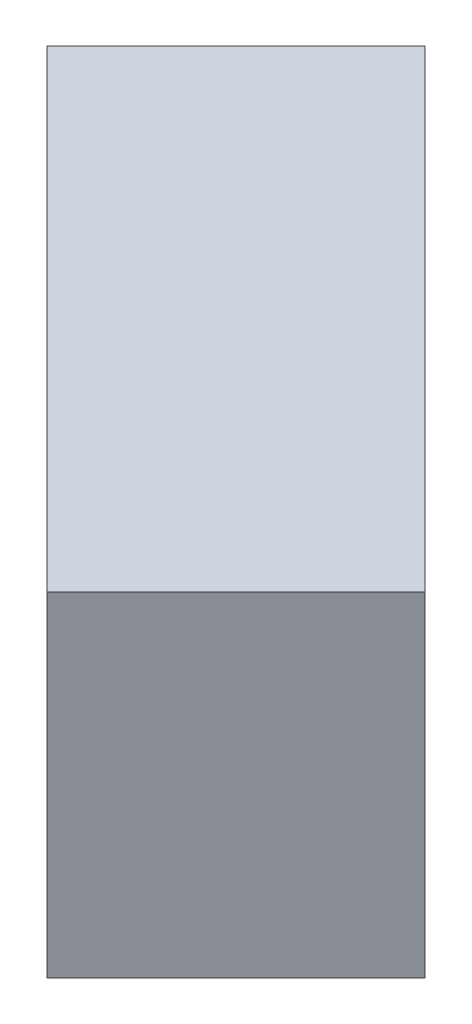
from build123d import *

# Parameters (mm, degrees)
SKIZZE1_W                       = 100
SKIZZE1_H                       = 50
AUFSATZ_LINEAR_AUSTRAGEN1_DEPTH = 40
SKIZZE2_R                       = 10
SCHNITT_LINEAR_AUSTRAGEN1_DEPTH = 40


with BuildPart() as part:
    # Skizze1 → Aufsatz-Linear austragen1 (new body)
    with BuildSketch(Plane(origin=(-141.421356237, 0, 141.421356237), x_dir=(-0.7071067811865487, 0, -0.7071067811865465), z_dir=(0.7071067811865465, 0, -0.7071067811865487))):
        with Locations((0, -175)):
            Rectangle(SKIZZE1_W, SKIZZE1_H)
    extrude(amount=-AUFSATZ_LINEAR_AUSTRAGEN1_DEPTH)

    # Skizze2 → Schnitt-Linear austragen1 (cut)
    with BuildSketch(Plane(origin=(-141.421356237, 0, 141.421356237), x_dir=(-0.7071067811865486, 0, -0.7071067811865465), z_dir=(0.7071067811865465, 0, -0.7071067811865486))):
        with Locations((35, -165)):
            Circle(SKIZZE2_R)
    extrude(amount=-SCHNITT_LINEAR_AUSTRAGEN1_DEPTH, mode=Mode.SUBTRACT)


solid = part.part
